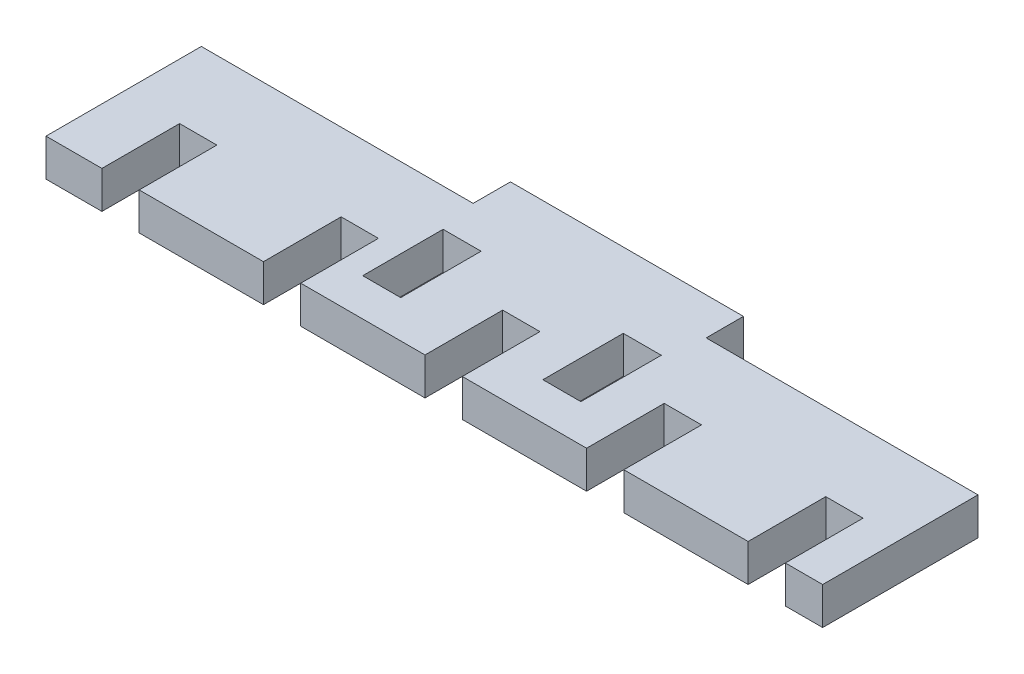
ISO-10303-21;
HEADER;
FILE_DESCRIPTION(('STEP AP214'),'2;1');
FILE_NAME('part.step','',(''),(''),'','','');
FILE_SCHEMA(('AUTOMOTIVE_DESIGN { 1 0 10303 214 1 1 1 1 }'));
ENDSEC;
DATA;
#1=APPLICATION_CONTEXT('core data for automotive mechanical design processes');
#2=APPLICATION_PROTOCOL_DEFINITION('international standard','automotive_design',2000,#1);
#3=PRODUCT_CONTEXT('',#1,'mechanical');
#4=PRODUCT('Part','Part','',(#3));
#5=PRODUCT_RELATED_PRODUCT_CATEGORY('part','',(#4));
#6=PRODUCT_DEFINITION_FORMATION('','',#4);
#7=PRODUCT_DEFINITION_CONTEXT('part definition',#1,'design');
#8=PRODUCT_DEFINITION('design','',#6,#7);
#9=PRODUCT_DEFINITION_SHAPE('','',#8);
#10=(LENGTH_UNIT() NAMED_UNIT(*) SI_UNIT(.MILLI.,.METRE.));
#11=(NAMED_UNIT(*) PLANE_ANGLE_UNIT() SI_UNIT($,.RADIAN.));
#12=(NAMED_UNIT(*) SI_UNIT($,.STERADIAN.) SOLID_ANGLE_UNIT());
#13=UNCERTAINTY_MEASURE_WITH_UNIT(LENGTH_MEASURE(1.E-05),#10,'distance_accuracy_value','');
#14=(GEOMETRIC_REPRESENTATION_CONTEXT(3) GLOBAL_UNCERTAINTY_ASSIGNED_CONTEXT((#13)) GLOBAL_UNIT_ASSIGNED_CONTEXT((#10,
#11,#12)) REPRESENTATION_CONTEXT('',''));
#15=CARTESIAN_POINT('',(0.,0.,0.));
#16=DIRECTION('',(0.,0.,1.));
#17=DIRECTION('',(1.,0.,0.));
#18=AXIS2_PLACEMENT_3D('',#15,#16,#17);
#19=CARTESIAN_POINT('',(0.,1.524,0.));
#20=DIRECTION('',(0.,1.,0.));
#21=DIRECTION('',(0.,0.,1.));
#22=AXIS2_PLACEMENT_3D('',#19,#20,#21);
#23=PLANE('',#22);
#24=DIRECTION('',(1.,0.,0.));
#25=VECTOR('',#24,1.);
#26=CARTESIAN_POINT('',(9.22231229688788,1.524,4.81768318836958));
#27=LINE('',#26,#25);
#28=CARTESIAN_POINT('',(7.66868770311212,1.524,4.81768318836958));
#29=VERTEX_POINT('',#28);
#30=CARTESIAN_POINT('',(9.22231229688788,1.524,4.81768318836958));
#31=VERTEX_POINT('',#30);
#32=EDGE_CURVE('E309',#29,#31,#27,.T.);
#33=ORIENTED_EDGE('',*,*,#32,.F.);
#34=DIRECTION('',(0.,0.,1.));
#35=VECTOR('',#34,1.);
#36=CARTESIAN_POINT('',(7.66868770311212,1.524,1.5323168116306));
#37=LINE('',#36,#35);
#38=CARTESIAN_POINT('',(7.66868770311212,1.524,1.5323168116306));
#39=VERTEX_POINT('',#38);
#40=EDGE_CURVE('E307',#39,#29,#37,.T.);
#41=ORIENTED_EDGE('',*,*,#40,.F.);
#42=DIRECTION('',(-1.,0.,0.));
#43=VECTOR('',#42,1.);
#44=CARTESIAN_POINT('',(9.22231229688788,1.524,1.5323168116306));
#45=LINE('',#44,#43);
#46=CARTESIAN_POINT('',(9.22231229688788,1.524,1.5323168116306));
#47=VERTEX_POINT('',#46);
#48=EDGE_CURVE('E315',#47,#39,#45,.T.);
#49=ORIENTED_EDGE('',*,*,#48,.F.);
#50=DIRECTION('',(0.,0.,-1.));
#51=VECTOR('',#50,1.);
#52=CARTESIAN_POINT('',(9.22231229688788,1.524,1.5323168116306));
#53=LINE('',#52,#51);
#54=EDGE_CURVE('E312',#31,#47,#53,.T.);
#55=ORIENTED_EDGE('',*,*,#54,.F.);
#56=EDGE_LOOP('',(#33,#41,#49,#55));
#57=FACE_BOUND('',#56,.T.);
#58=DIRECTION('',(-1.,0.,0.));
#59=VECTOR('',#58,1.);
#60=CARTESIAN_POINT('',(0.,1.524,0.));
#61=LINE('',#60,#59);
#62=CARTESIAN_POINT('',(0.,1.524,0.));
#63=VERTEX_POINT('',#62);
#64=CARTESIAN_POINT('',(-11.1125,1.524,0.));
#65=VERTEX_POINT('',#64);
#66=EDGE_CURVE('E338',#63,#65,#61,.T.);
#67=ORIENTED_EDGE('',*,*,#66,.T.);
#68=DIRECTION('',(0.,0.,1.));
#69=VECTOR('',#68,1.);
#70=CARTESIAN_POINT('',(-11.1125,1.524,0.));
#71=LINE('',#70,#69);
#72=CARTESIAN_POINT('',(-11.1125,1.524,6.35));
#73=VERTEX_POINT('',#72);
#74=EDGE_CURVE('E341',#65,#73,#71,.T.);
#75=ORIENTED_EDGE('',*,*,#74,.T.);
#76=DIRECTION('',(1.,0.,0.));
#77=VECTOR('',#76,1.);
#78=CARTESIAN_POINT('',(-11.1125,1.524,6.35));
#79=LINE('',#78,#77);
#80=CARTESIAN_POINT('',(-8.8265,1.524,6.35000000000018));
#81=VERTEX_POINT('',#80);
#82=EDGE_CURVE('E344',#73,#81,#79,.T.);
#83=ORIENTED_EDGE('',*,*,#82,.T.);
#84=DIRECTION('',(0.,0.,-1.));
#85=VECTOR('',#84,1.);
#86=CARTESIAN_POINT('',(-8.8265,1.524,3.17500000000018));
#87=LINE('',#86,#85);
#88=CARTESIAN_POINT('',(-8.8265,1.524,3.17500000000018));
#89=VERTEX_POINT('',#88);
#90=EDGE_CURVE('E346',#81,#89,#87,.T.);
#91=ORIENTED_EDGE('',*,*,#90,.T.);
#92=DIRECTION('',(1.,0.,0.));
#93=VECTOR('',#92,1.);
#94=CARTESIAN_POINT('',(-7.3025,1.524,3.17500000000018));
#95=LINE('',#94,#93);
#96=CARTESIAN_POINT('',(-7.3025,1.524,3.17500000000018));
#97=VERTEX_POINT('',#96);
#98=EDGE_CURVE('E348',#89,#97,#95,.T.);
#99=ORIENTED_EDGE('',*,*,#98,.T.);
#100=DIRECTION('',(0.,0.,1.));
#101=VECTOR('',#100,1.);
#102=CARTESIAN_POINT('',(-7.3025,1.524,3.17500000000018));
#103=LINE('',#102,#101);
#104=CARTESIAN_POINT('',(-7.3025,1.524,6.35000000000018));
#105=VERTEX_POINT('',#104);
#106=EDGE_CURVE('E350',#97,#105,#103,.T.);
#107=ORIENTED_EDGE('',*,*,#106,.T.);
#108=DIRECTION('',(1.,0.,0.));
#109=VECTOR('',#108,1.);
#110=CARTESIAN_POINT('',(-7.3025,1.524,6.35000000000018));
#111=LINE('',#110,#109);
#112=CARTESIAN_POINT('',(-2.2225,1.524,6.35000000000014));
#113=VERTEX_POINT('',#112);
#114=EDGE_CURVE('E352',#105,#113,#111,.T.);
#115=ORIENTED_EDGE('',*,*,#114,.T.);
#116=DIRECTION('',(0.,0.,-1.));
#117=VECTOR('',#116,1.);
#118=CARTESIAN_POINT('',(-2.2225,1.524,3.17500000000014));
#119=LINE('',#118,#117);
#120=CARTESIAN_POINT('',(-2.2225,1.524,3.17500000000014));
#121=VERTEX_POINT('',#120);
#122=EDGE_CURVE('E354',#113,#121,#119,.T.);
#123=ORIENTED_EDGE('',*,*,#122,.T.);
#124=DIRECTION('',(1.,0.,0.));
#125=VECTOR('',#124,1.);
#126=CARTESIAN_POINT('',(-0.698500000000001,1.524,3.17500000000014));
#127=LINE('',#126,#125);
#128=CARTESIAN_POINT('',(-0.698500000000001,1.524,3.17500000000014));
#129=VERTEX_POINT('',#128);
#130=EDGE_CURVE('E356',#121,#129,#127,.T.);
#131=ORIENTED_EDGE('',*,*,#130,.T.);
#132=DIRECTION('',(0.,0.,1.));
#133=VECTOR('',#132,1.);
#134=CARTESIAN_POINT('',(-0.698500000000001,1.524,3.17500000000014));
#135=LINE('',#134,#133);
#136=CARTESIAN_POINT('',(-0.698500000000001,1.524,6.35000000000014));
#137=VERTEX_POINT('',#136);
#138=EDGE_CURVE('E358',#129,#137,#135,.T.);
#139=ORIENTED_EDGE('',*,*,#138,.T.);
#140=DIRECTION('',(1.,0.,0.));
#141=VECTOR('',#140,1.);
#142=CARTESIAN_POINT('',(-0.698500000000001,1.524,6.35000000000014));
#143=LINE('',#142,#141);
#144=CARTESIAN_POINT('',(4.3815,1.524,6.35000000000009));
#145=VERTEX_POINT('',#144);
#146=EDGE_CURVE('E360',#137,#145,#143,.T.);
#147=ORIENTED_EDGE('',*,*,#146,.T.);
#148=DIRECTION('',(0.,0.,-1.));
#149=VECTOR('',#148,1.);
#150=CARTESIAN_POINT('',(4.3815,1.524,3.17500000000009));
#151=LINE('',#150,#149);
#152=CARTESIAN_POINT('',(4.3815,1.524,3.17500000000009));
#153=VERTEX_POINT('',#152);
#154=EDGE_CURVE('E362',#145,#153,#151,.T.);
#155=ORIENTED_EDGE('',*,*,#154,.T.);
#156=DIRECTION('',(1.,0.,0.));
#157=VECTOR('',#156,1.);
#158=CARTESIAN_POINT('',(5.9055,1.524,3.17500000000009));
#159=LINE('',#158,#157);
#160=CARTESIAN_POINT('',(5.9055,1.524,3.17500000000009));
#161=VERTEX_POINT('',#160);
#162=EDGE_CURVE('E364',#153,#161,#159,.T.);
#163=ORIENTED_EDGE('',*,*,#162,.T.);
#164=DIRECTION('',(0.,0.,1.));
#165=VECTOR('',#164,1.);
#166=CARTESIAN_POINT('',(5.9055,1.524,3.17500000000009));
#167=LINE('',#166,#165);
#168=CARTESIAN_POINT('',(5.9055,1.524,6.35000000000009));
#169=VERTEX_POINT('',#168);
#170=EDGE_CURVE('E366',#161,#169,#167,.T.);
#171=ORIENTED_EDGE('',*,*,#170,.T.);
#172=DIRECTION('',(1.,0.,0.));
#173=VECTOR('',#172,1.);
#174=CARTESIAN_POINT('',(5.9055,1.524,6.35000000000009));
#175=LINE('',#174,#173);
#176=CARTESIAN_POINT('',(10.9855,1.524,6.35000000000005));
#177=VERTEX_POINT('',#176);
#178=EDGE_CURVE('E368',#169,#177,#175,.T.);
#179=ORIENTED_EDGE('',*,*,#178,.T.);
#180=DIRECTION('',(0.,0.,-1.));
#181=VECTOR('',#180,1.);
#182=CARTESIAN_POINT('',(10.9855,1.524,3.17500000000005));
#183=LINE('',#182,#181);
#184=CARTESIAN_POINT('',(10.9855,1.524,3.17500000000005));
#185=VERTEX_POINT('',#184);
#186=EDGE_CURVE('E370',#177,#185,#183,.T.);
#187=ORIENTED_EDGE('',*,*,#186,.T.);
#188=DIRECTION('',(1.,0.,0.));
#189=VECTOR('',#188,1.);
#190=CARTESIAN_POINT('',(12.5095,1.524,3.17500000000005));
#191=LINE('',#190,#189);
#192=CARTESIAN_POINT('',(12.5095,1.524,3.17500000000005));
#193=VERTEX_POINT('',#192);
#194=EDGE_CURVE('E372',#185,#193,#191,.T.);
#195=ORIENTED_EDGE('',*,*,#194,.T.);
#196=DIRECTION('',(0.,0.,1.));
#197=VECTOR('',#196,1.);
#198=CARTESIAN_POINT('',(12.5095,1.524,3.17500000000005));
#199=LINE('',#198,#197);
#200=CARTESIAN_POINT('',(12.5095,1.524,6.35000000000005));
#201=VERTEX_POINT('',#200);
#202=EDGE_CURVE('E374',#193,#201,#199,.T.);
#203=ORIENTED_EDGE('',*,*,#202,.T.);
#204=DIRECTION('',(1.,0.,0.));
#205=VECTOR('',#204,1.);
#206=CARTESIAN_POINT('',(12.5095,1.524,6.35000000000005));
#207=LINE('',#206,#205);
#208=CARTESIAN_POINT('',(17.5895,1.524,6.35));
#209=VERTEX_POINT('',#208);
#210=EDGE_CURVE('E376',#201,#209,#207,.T.);
#211=ORIENTED_EDGE('',*,*,#210,.T.);
#212=DIRECTION('',(0.,0.,-1.));
#213=VECTOR('',#212,1.);
#214=CARTESIAN_POINT('',(17.5895,1.524,3.175));
#215=LINE('',#214,#213);
#216=CARTESIAN_POINT('',(17.5895,1.524,3.175));
#217=VERTEX_POINT('',#216);
#218=EDGE_CURVE('E378',#209,#217,#215,.T.);
#219=ORIENTED_EDGE('',*,*,#218,.T.);
#220=DIRECTION('',(1.,0.,0.));
#221=VECTOR('',#220,1.);
#222=CARTESIAN_POINT('',(19.1135,1.524,3.175));
#223=LINE('',#222,#221);
#224=CARTESIAN_POINT('',(19.1135,1.524,3.175));
#225=VERTEX_POINT('',#224);
#226=EDGE_CURVE('E380',#217,#225,#223,.T.);
#227=ORIENTED_EDGE('',*,*,#226,.T.);
#228=DIRECTION('',(0.,0.,1.));
#229=VECTOR('',#228,1.);
#230=CARTESIAN_POINT('',(19.1135,1.524,3.175));
#231=LINE('',#230,#229);
#232=CARTESIAN_POINT('',(19.1135,1.524,6.35));
#233=VERTEX_POINT('',#232);
#234=EDGE_CURVE('E382',#225,#233,#231,.T.);
#235=ORIENTED_EDGE('',*,*,#234,.T.);
#236=DIRECTION('',(1.,0.,0.));
#237=VECTOR('',#236,1.);
#238=CARTESIAN_POINT('',(19.1135,1.524,6.35));
#239=LINE('',#238,#237);
#240=CARTESIAN_POINT('',(20.6375,1.524,6.35));
#241=VERTEX_POINT('',#240);
#242=EDGE_CURVE('E384',#233,#241,#239,.T.);
#243=ORIENTED_EDGE('',*,*,#242,.T.);
#244=DIRECTION('',(0.,0.,-1.));
#245=VECTOR('',#244,1.);
#246=CARTESIAN_POINT('',(20.6375,1.524,0.));
#247=LINE('',#246,#245);
#248=CARTESIAN_POINT('',(20.6375,1.524,0.));
#249=VERTEX_POINT('',#248);
#250=EDGE_CURVE('E386',#241,#249,#247,.T.);
#251=ORIENTED_EDGE('',*,*,#250,.T.);
#252=DIRECTION('',(-1.,0.,0.));
#253=VECTOR('',#252,1.);
#254=CARTESIAN_POINT('',(20.6375,1.524,0.));
#255=LINE('',#254,#253);
#256=CARTESIAN_POINT('',(9.525,1.524,0.));
#257=VERTEX_POINT('',#256);
#258=EDGE_CURVE('E388',#249,#257,#255,.T.);
#259=ORIENTED_EDGE('',*,*,#258,.T.);
#260=DIRECTION('',(0.,0.,-1.));
#261=VECTOR('',#260,1.);
#262=CARTESIAN_POINT('',(9.525,1.524,0.));
#263=LINE('',#262,#261);
#264=CARTESIAN_POINT('',(9.525,1.524,-1.524));
#265=VERTEX_POINT('',#264);
#266=EDGE_CURVE('E390',#257,#265,#263,.T.);
#267=ORIENTED_EDGE('',*,*,#266,.T.);
#268=DIRECTION('',(-1.,0.,0.));
#269=VECTOR('',#268,1.);
#270=CARTESIAN_POINT('',(0.,1.524,-1.524));
#271=LINE('',#270,#269);
#272=CARTESIAN_POINT('',(0.,1.524,-1.524));
#273=VERTEX_POINT('',#272);
#274=EDGE_CURVE('E392',#265,#273,#271,.T.);
#275=ORIENTED_EDGE('',*,*,#274,.T.);
#276=DIRECTION('',(0.,0.,1.));
#277=VECTOR('',#276,1.);
#278=CARTESIAN_POINT('',(0.,1.524,0.));
#279=LINE('',#278,#277);
#280=EDGE_CURVE('E394',#273,#63,#279,.T.);
#281=ORIENTED_EDGE('',*,*,#280,.T.);
#282=EDGE_LOOP('',(#67,#75,#83,#91,#99,#107,#115,#123,#131,#139,#147,#155,#163,#171,#179,#187,
#195,#203,#211,#219,#227,#235,#243,#251,#259,#267,#275,#281));
#283=FACE_BOUND('',#282,.T.);
#284=DIRECTION('',(1.,0.,0.));
#285=VECTOR('',#284,1.);
#286=CARTESIAN_POINT('',(0.302687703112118,1.524,4.81768318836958));
#287=LINE('',#286,#285);
#288=CARTESIAN_POINT('',(0.302687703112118,1.524,4.81768318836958));
#289=VERTEX_POINT('',#288);
#290=CARTESIAN_POINT('',(1.85631229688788,1.524,4.81768318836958));
#291=VERTEX_POINT('',#290);
#292=EDGE_CURVE('E279',#289,#291,#287,.T.);
#293=ORIENTED_EDGE('',*,*,#292,.F.);
#294=DIRECTION('',(0.,0.,1.));
#295=VECTOR('',#294,1.);
#296=CARTESIAN_POINT('',(0.302687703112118,1.524,1.5323168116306));
#297=LINE('',#296,#295);
#298=CARTESIAN_POINT('',(0.302687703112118,1.524,1.5323168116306));
#299=VERTEX_POINT('',#298);
#300=EDGE_CURVE('E271',#299,#289,#297,.T.);
#301=ORIENTED_EDGE('',*,*,#300,.F.);
#302=DIRECTION('',(-1.,0.,0.));
#303=VECTOR('',#302,1.);
#304=CARTESIAN_POINT('',(0.302687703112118,1.524,1.5323168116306));
#305=LINE('',#304,#303);
#306=CARTESIAN_POINT('',(1.85631229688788,1.524,1.5323168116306));
#307=VERTEX_POINT('',#306);
#308=EDGE_CURVE('E293',#307,#299,#305,.T.);
#309=ORIENTED_EDGE('',*,*,#308,.F.);
#310=DIRECTION('',(0.,0.,-1.));
#311=VECTOR('',#310,1.);
#312=CARTESIAN_POINT('',(1.85631229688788,1.524,1.5323168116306));
#313=LINE('',#312,#311);
#314=EDGE_CURVE('E291',#291,#307,#313,.T.);
#315=ORIENTED_EDGE('',*,*,#314,.F.);
#316=EDGE_LOOP('',(#293,#301,#309,#315));
#317=FACE_BOUND('',#316,.T.);
#318=ADVANCED_FACE('F38',(#57,#283,#317),#23,.T.);
#319=CARTESIAN_POINT('',(0.,0.,0.));
#320=DIRECTION('',(0.,1.,0.));
#321=DIRECTION('',(0.,0.,1.));
#322=AXIS2_PLACEMENT_3D('',#319,#320,#321);
#323=PLANE('',#322);
#324=DIRECTION('',(0.,0.,1.));
#325=VECTOR('',#324,1.);
#326=CARTESIAN_POINT('',(7.66868770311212,0.,1.5323168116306));
#327=LINE('',#326,#325);
#328=CARTESIAN_POINT('',(7.66868770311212,0.,1.5323168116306));
#329=VERTEX_POINT('',#328);
#330=CARTESIAN_POINT('',(7.66868770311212,0.,4.81768318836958));
#331=VERTEX_POINT('',#330);
#332=EDGE_CURVE('E287',#329,#331,#327,.T.);
#333=ORIENTED_EDGE('',*,*,#332,.T.);
#334=DIRECTION('',(1.,0.,0.));
#335=VECTOR('',#334,1.);
#336=CARTESIAN_POINT('',(9.22231229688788,0.,4.81768318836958));
#337=LINE('',#336,#335);
#338=CARTESIAN_POINT('',(9.22231229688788,0.,4.81768318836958));
#339=VERTEX_POINT('',#338);
#340=EDGE_CURVE('E320',#331,#339,#337,.T.);
#341=ORIENTED_EDGE('',*,*,#340,.T.);
#342=DIRECTION('',(0.,0.,-1.));
#343=VECTOR('',#342,1.);
#344=CARTESIAN_POINT('',(9.22231229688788,0.,1.5323168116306));
#345=LINE('',#344,#343);
#346=CARTESIAN_POINT('',(9.22231229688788,0.,1.5323168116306));
#347=VERTEX_POINT('',#346);
#348=EDGE_CURVE('E323',#339,#347,#345,.T.);
#349=ORIENTED_EDGE('',*,*,#348,.T.);
#350=DIRECTION('',(-1.,0.,0.));
#351=VECTOR('',#350,1.);
#352=CARTESIAN_POINT('',(9.22231229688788,0.,1.5323168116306));
#353=LINE('',#352,#351);
#354=EDGE_CURVE('E310',#347,#329,#353,.T.);
#355=ORIENTED_EDGE('',*,*,#354,.T.);
#356=EDGE_LOOP('',(#333,#341,#349,#355));
#357=FACE_BOUND('',#356,.T.);
#358=DIRECTION('',(-1.,0.,0.));
#359=VECTOR('',#358,1.);
#360=CARTESIAN_POINT('',(0.,0.,0.));
#361=LINE('',#360,#359);
#362=CARTESIAN_POINT('',(0.,0.,0.));
#363=VERTEX_POINT('',#362);
#364=CARTESIAN_POINT('',(-11.1125,0.,0.));
#365=VERTEX_POINT('',#364);
#366=EDGE_CURVE('E337',#363,#365,#361,.T.);
#367=ORIENTED_EDGE('',*,*,#366,.F.);
#368=DIRECTION('',(0.,0.,1.));
#369=VECTOR('',#368,1.);
#370=CARTESIAN_POINT('',(0.,0.,0.));
#371=LINE('',#370,#369);
#372=CARTESIAN_POINT('',(0.,0.,-1.524));
#373=VERTEX_POINT('',#372);
#374=EDGE_CURVE('E342',#373,#363,#371,.T.);
#375=ORIENTED_EDGE('',*,*,#374,.F.);
#376=DIRECTION('',(-1.,0.,0.));
#377=VECTOR('',#376,1.);
#378=CARTESIAN_POINT('',(0.,0.,-1.524));
#379=LINE('',#378,#377);
#380=CARTESIAN_POINT('',(9.525,0.,-1.524));
#381=VERTEX_POINT('',#380);
#382=EDGE_CURVE('E449',#381,#373,#379,.T.);
#383=ORIENTED_EDGE('',*,*,#382,.F.);
#384=DIRECTION('',(0.,0.,-1.));
#385=VECTOR('',#384,1.);
#386=CARTESIAN_POINT('',(9.525,0.,0.));
#387=LINE('',#386,#385);
#388=CARTESIAN_POINT('',(9.525,0.,0.));
#389=VERTEX_POINT('',#388);
#390=EDGE_CURVE('E447',#389,#381,#387,.T.);
#391=ORIENTED_EDGE('',*,*,#390,.F.);
#392=DIRECTION('',(-1.,0.,0.));
#393=VECTOR('',#392,1.);
#394=CARTESIAN_POINT('',(20.6375,0.,0.));
#395=LINE('',#394,#393);
#396=CARTESIAN_POINT('',(20.6375,0.,0.));
#397=VERTEX_POINT('',#396);
#398=EDGE_CURVE('E445',#397,#389,#395,.T.);
#399=ORIENTED_EDGE('',*,*,#398,.F.);
#400=DIRECTION('',(0.,0.,-1.));
#401=VECTOR('',#400,1.);
#402=CARTESIAN_POINT('',(20.6375,0.,0.));
#403=LINE('',#402,#401);
#404=CARTESIAN_POINT('',(20.6375,0.,6.35));
#405=VERTEX_POINT('',#404);
#406=EDGE_CURVE('E443',#405,#397,#403,.T.);
#407=ORIENTED_EDGE('',*,*,#406,.F.);
#408=DIRECTION('',(1.,0.,0.));
#409=VECTOR('',#408,1.);
#410=CARTESIAN_POINT('',(19.1135,0.,6.35));
#411=LINE('',#410,#409);
#412=CARTESIAN_POINT('',(19.1135,0.,6.35));
#413=VERTEX_POINT('',#412);
#414=EDGE_CURVE('E441',#413,#405,#411,.T.);
#415=ORIENTED_EDGE('',*,*,#414,.F.);
#416=DIRECTION('',(0.,0.,1.));
#417=VECTOR('',#416,1.);
#418=CARTESIAN_POINT('',(19.1135,0.,3.175));
#419=LINE('',#418,#417);
#420=CARTESIAN_POINT('',(19.1135,0.,3.175));
#421=VERTEX_POINT('',#420);
#422=EDGE_CURVE('E439',#421,#413,#419,.T.);
#423=ORIENTED_EDGE('',*,*,#422,.F.);
#424=DIRECTION('',(1.,0.,0.));
#425=VECTOR('',#424,1.);
#426=CARTESIAN_POINT('',(19.1135,0.,3.175));
#427=LINE('',#426,#425);
#428=CARTESIAN_POINT('',(17.5895,0.,3.175));
#429=VERTEX_POINT('',#428);
#430=EDGE_CURVE('E437',#429,#421,#427,.T.);
#431=ORIENTED_EDGE('',*,*,#430,.F.);
#432=DIRECTION('',(0.,0.,-1.));
#433=VECTOR('',#432,1.);
#434=CARTESIAN_POINT('',(17.5895,0.,3.175));
#435=LINE('',#434,#433);
#436=CARTESIAN_POINT('',(17.5895,0.,6.35));
#437=VERTEX_POINT('',#436);
#438=EDGE_CURVE('E435',#437,#429,#435,.T.);
#439=ORIENTED_EDGE('',*,*,#438,.F.);
#440=DIRECTION('',(1.,0.,0.));
#441=VECTOR('',#440,1.);
#442=CARTESIAN_POINT('',(12.5095,0.,6.35000000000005));
#443=LINE('',#442,#441);
#444=CARTESIAN_POINT('',(12.5095,0.,6.35000000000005));
#445=VERTEX_POINT('',#444);
#446=EDGE_CURVE('E433',#445,#437,#443,.T.);
#447=ORIENTED_EDGE('',*,*,#446,.F.);
#448=DIRECTION('',(0.,0.,1.));
#449=VECTOR('',#448,1.);
#450=CARTESIAN_POINT('',(12.5095,0.,3.17500000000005));
#451=LINE('',#450,#449);
#452=CARTESIAN_POINT('',(12.5095,0.,3.17500000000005));
#453=VERTEX_POINT('',#452);
#454=EDGE_CURVE('E431',#453,#445,#451,.T.);
#455=ORIENTED_EDGE('',*,*,#454,.F.);
#456=DIRECTION('',(1.,0.,0.));
#457=VECTOR('',#456,1.);
#458=CARTESIAN_POINT('',(12.5095,0.,3.17500000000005));
#459=LINE('',#458,#457);
#460=CARTESIAN_POINT('',(10.9855,0.,3.17500000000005));
#461=VERTEX_POINT('',#460);
#462=EDGE_CURVE('E429',#461,#453,#459,.T.);
#463=ORIENTED_EDGE('',*,*,#462,.F.);
#464=DIRECTION('',(0.,0.,-1.));
#465=VECTOR('',#464,1.);
#466=CARTESIAN_POINT('',(10.9855,0.,3.17500000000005));
#467=LINE('',#466,#465);
#468=CARTESIAN_POINT('',(10.9855,0.,6.35000000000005));
#469=VERTEX_POINT('',#468);
#470=EDGE_CURVE('E427',#469,#461,#467,.T.);
#471=ORIENTED_EDGE('',*,*,#470,.F.);
#472=DIRECTION('',(1.,0.,0.));
#473=VECTOR('',#472,1.);
#474=CARTESIAN_POINT('',(5.9055,0.,6.35000000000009));
#475=LINE('',#474,#473);
#476=CARTESIAN_POINT('',(5.9055,0.,6.35000000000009));
#477=VERTEX_POINT('',#476);
#478=EDGE_CURVE('E425',#477,#469,#475,.T.);
#479=ORIENTED_EDGE('',*,*,#478,.F.);
#480=DIRECTION('',(0.,0.,1.));
#481=VECTOR('',#480,1.);
#482=CARTESIAN_POINT('',(5.9055,0.,3.17500000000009));
#483=LINE('',#482,#481);
#484=CARTESIAN_POINT('',(5.9055,0.,3.17500000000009));
#485=VERTEX_POINT('',#484);
#486=EDGE_CURVE('E423',#485,#477,#483,.T.);
#487=ORIENTED_EDGE('',*,*,#486,.F.);
#488=DIRECTION('',(1.,0.,0.));
#489=VECTOR('',#488,1.);
#490=CARTESIAN_POINT('',(5.9055,0.,3.17500000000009));
#491=LINE('',#490,#489);
#492=CARTESIAN_POINT('',(4.3815,0.,3.17500000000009));
#493=VERTEX_POINT('',#492);
#494=EDGE_CURVE('E421',#493,#485,#491,.T.);
#495=ORIENTED_EDGE('',*,*,#494,.F.);
#496=DIRECTION('',(0.,0.,-1.));
#497=VECTOR('',#496,1.);
#498=CARTESIAN_POINT('',(4.3815,0.,3.17500000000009));
#499=LINE('',#498,#497);
#500=CARTESIAN_POINT('',(4.3815,0.,6.35000000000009));
#501=VERTEX_POINT('',#500);
#502=EDGE_CURVE('E419',#501,#493,#499,.T.);
#503=ORIENTED_EDGE('',*,*,#502,.F.);
#504=DIRECTION('',(1.,0.,0.));
#505=VECTOR('',#504,1.);
#506=CARTESIAN_POINT('',(-0.698500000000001,0.,6.35000000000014));
#507=LINE('',#506,#505);
#508=CARTESIAN_POINT('',(-0.698500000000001,0.,6.35000000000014));
#509=VERTEX_POINT('',#508);
#510=EDGE_CURVE('E417',#509,#501,#507,.T.);
#511=ORIENTED_EDGE('',*,*,#510,.F.);
#512=DIRECTION('',(0.,0.,1.));
#513=VECTOR('',#512,1.);
#514=CARTESIAN_POINT('',(-0.698500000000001,0.,3.17500000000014));
#515=LINE('',#514,#513);
#516=CARTESIAN_POINT('',(-0.698500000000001,0.,3.17500000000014));
#517=VERTEX_POINT('',#516);
#518=EDGE_CURVE('E415',#517,#509,#515,.T.);
#519=ORIENTED_EDGE('',*,*,#518,.F.);
#520=DIRECTION('',(1.,0.,0.));
#521=VECTOR('',#520,1.);
#522=CARTESIAN_POINT('',(-0.698500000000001,0.,3.17500000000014));
#523=LINE('',#522,#521);
#524=CARTESIAN_POINT('',(-2.2225,0.,3.17500000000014));
#525=VERTEX_POINT('',#524);
#526=EDGE_CURVE('E413',#525,#517,#523,.T.);
#527=ORIENTED_EDGE('',*,*,#526,.F.);
#528=DIRECTION('',(0.,0.,-1.));
#529=VECTOR('',#528,1.);
#530=CARTESIAN_POINT('',(-2.2225,0.,3.17500000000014));
#531=LINE('',#530,#529);
#532=CARTESIAN_POINT('',(-2.2225,0.,6.35000000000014));
#533=VERTEX_POINT('',#532);
#534=EDGE_CURVE('E411',#533,#525,#531,.T.);
#535=ORIENTED_EDGE('',*,*,#534,.F.);
#536=DIRECTION('',(1.,0.,0.));
#537=VECTOR('',#536,1.);
#538=CARTESIAN_POINT('',(-7.3025,0.,6.35000000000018));
#539=LINE('',#538,#537);
#540=CARTESIAN_POINT('',(-7.3025,0.,6.35000000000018));
#541=VERTEX_POINT('',#540);
#542=EDGE_CURVE('E409',#541,#533,#539,.T.);
#543=ORIENTED_EDGE('',*,*,#542,.F.);
#544=DIRECTION('',(0.,0.,1.));
#545=VECTOR('',#544,1.);
#546=CARTESIAN_POINT('',(-7.3025,0.,3.17500000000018));
#547=LINE('',#546,#545);
#548=CARTESIAN_POINT('',(-7.3025,0.,3.17500000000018));
#549=VERTEX_POINT('',#548);
#550=EDGE_CURVE('E407',#549,#541,#547,.T.);
#551=ORIENTED_EDGE('',*,*,#550,.F.);
#552=DIRECTION('',(1.,0.,0.));
#553=VECTOR('',#552,1.);
#554=CARTESIAN_POINT('',(-7.3025,0.,3.17500000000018));
#555=LINE('',#554,#553);
#556=CARTESIAN_POINT('',(-8.8265,0.,3.17500000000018));
#557=VERTEX_POINT('',#556);
#558=EDGE_CURVE('E405',#557,#549,#555,.T.);
#559=ORIENTED_EDGE('',*,*,#558,.F.);
#560=DIRECTION('',(0.,0.,-1.));
#561=VECTOR('',#560,1.);
#562=CARTESIAN_POINT('',(-8.8265,0.,3.17500000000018));
#563=LINE('',#562,#561);
#564=CARTESIAN_POINT('',(-8.8265,0.,6.35000000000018));
#565=VERTEX_POINT('',#564);
#566=EDGE_CURVE('E403',#565,#557,#563,.T.);
#567=ORIENTED_EDGE('',*,*,#566,.F.);
#568=DIRECTION('',(1.,0.,0.));
#569=VECTOR('',#568,1.);
#570=CARTESIAN_POINT('',(-11.1125,0.,6.35));
#571=LINE('',#570,#569);
#572=CARTESIAN_POINT('',(-11.1125,0.,6.35));
#573=VERTEX_POINT('',#572);
#574=EDGE_CURVE('E401',#573,#565,#571,.T.);
#575=ORIENTED_EDGE('',*,*,#574,.F.);
#576=DIRECTION('',(0.,0.,1.));
#577=VECTOR('',#576,1.);
#578=CARTESIAN_POINT('',(-11.1125,0.,0.));
#579=LINE('',#578,#577);
#580=EDGE_CURVE('E399',#365,#573,#579,.T.);
#581=ORIENTED_EDGE('',*,*,#580,.F.);
#582=EDGE_LOOP('',(#367,#375,#383,#391,#399,#407,#415,#423,#431,#439,#447,#455,#463,#471,#479,
#487,#495,#503,#511,#519,#527,#535,#543,#551,#559,#567,#575,#581));
#583=FACE_BOUND('',#582,.T.);
#584=DIRECTION('',(0.,0.,1.));
#585=VECTOR('',#584,1.);
#586=CARTESIAN_POINT('',(0.302687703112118,0.,1.5323168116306));
#587=LINE('',#586,#585);
#588=CARTESIAN_POINT('',(0.302687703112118,0.,1.5323168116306));
#589=VERTEX_POINT('',#588);
#590=CARTESIAN_POINT('',(0.302687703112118,0.,4.81768318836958));
#591=VERTEX_POINT('',#590);
#592=EDGE_CURVE('E61',#589,#591,#587,.T.);
#593=ORIENTED_EDGE('',*,*,#592,.T.);
#594=DIRECTION('',(1.,0.,0.));
#595=VECTOR('',#594,1.);
#596=CARTESIAN_POINT('',(0.302687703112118,0.,4.81768318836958));
#597=LINE('',#596,#595);
#598=CARTESIAN_POINT('',(1.85631229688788,0.,4.81768318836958));
#599=VERTEX_POINT('',#598);
#600=EDGE_CURVE('E286',#591,#599,#597,.T.);
#601=ORIENTED_EDGE('',*,*,#600,.T.);
#602=DIRECTION('',(0.,0.,-1.));
#603=VECTOR('',#602,1.);
#604=CARTESIAN_POINT('',(1.85631229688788,0.,1.5323168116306));
#605=LINE('',#604,#603);
#606=CARTESIAN_POINT('',(1.85631229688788,0.,1.5323168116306));
#607=VERTEX_POINT('',#606);
#608=EDGE_CURVE('E299',#599,#607,#605,.T.);
#609=ORIENTED_EDGE('',*,*,#608,.T.);
#610=DIRECTION('',(-1.,0.,0.));
#611=VECTOR('',#610,1.);
#612=CARTESIAN_POINT('',(0.302687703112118,0.,1.5323168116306));
#613=LINE('',#612,#611);
#614=EDGE_CURVE('E280',#607,#589,#613,.T.);
#615=ORIENTED_EDGE('',*,*,#614,.T.);
#616=EDGE_LOOP('',(#593,#601,#609,#615));
#617=FACE_BOUND('',#616,.T.);
#618=ADVANCED_FACE('F539',(#357,#583,#617),#323,.F.);
#619=CARTESIAN_POINT('',(0.,1.524,0.));
#620=DIRECTION('',(0.,0.,1.));
#621=DIRECTION('',(1.,0.,0.));
#622=AXIS2_PLACEMENT_3D('',#619,#620,#621);
#623=PLANE('',#622);
#624=ORIENTED_EDGE('',*,*,#366,.T.);
#625=DIRECTION('',(0.,-1.,0.));
#626=VECTOR('',#625,1.);
#627=CARTESIAN_POINT('',(-11.1125,1.524,0.));
#628=LINE('',#627,#626);
#629=EDGE_CURVE('E11',#65,#365,#628,.T.);
#630=ORIENTED_EDGE('',*,*,#629,.F.);
#631=ORIENTED_EDGE('',*,*,#66,.F.);
#632=DIRECTION('',(0.,-1.,0.));
#633=VECTOR('',#632,1.);
#634=CARTESIAN_POINT('',(0.,1.524,0.));
#635=LINE('',#634,#633);
#636=EDGE_CURVE('E396',#63,#363,#635,.T.);
#637=ORIENTED_EDGE('',*,*,#636,.T.);
#638=EDGE_LOOP('',(#624,#630,#631,#637));
#639=FACE_BOUND('',#638,.T.);
#640=ADVANCED_FACE('F40',(#639),#623,.F.);
#641=CARTESIAN_POINT('',(-11.1125,1.524,0.));
#642=DIRECTION('',(1.,0.,0.));
#643=DIRECTION('',(0.,0.,-1.));
#644=AXIS2_PLACEMENT_3D('',#641,#642,#643);
#645=PLANE('',#644);
#646=ORIENTED_EDGE('',*,*,#580,.T.);
#647=DIRECTION('',(0.,-1.,0.));
#648=VECTOR('',#647,1.);
#649=CARTESIAN_POINT('',(-11.1125,1.524,6.35));
#650=LINE('',#649,#648);
#651=EDGE_CURVE('E46',#73,#573,#650,.T.);
#652=ORIENTED_EDGE('',*,*,#651,.F.);
#653=ORIENTED_EDGE('',*,*,#74,.F.);
#654=ORIENTED_EDGE('',*,*,#629,.T.);
#655=EDGE_LOOP('',(#646,#652,#653,#654));
#656=FACE_BOUND('',#655,.T.);
#657=ADVANCED_FACE('F556',(#656),#645,.F.);
#658=CARTESIAN_POINT('',(-11.1125,1.524,6.35));
#659=DIRECTION('',(0.,0.,-1.));
#660=DIRECTION('',(-1.,0.,0.));
#661=AXIS2_PLACEMENT_3D('',#658,#659,#660);
#662=PLANE('',#661);
#663=ORIENTED_EDGE('',*,*,#574,.T.);
#664=DIRECTION('',(0.,-1.,0.));
#665=VECTOR('',#664,1.);
#666=CARTESIAN_POINT('',(-8.8265,1.524,6.35000000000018));
#667=LINE('',#666,#665);
#668=EDGE_CURVE('E526',#81,#565,#667,.T.);
#669=ORIENTED_EDGE('',*,*,#668,.F.);
#670=ORIENTED_EDGE('',*,*,#82,.F.);
#671=ORIENTED_EDGE('',*,*,#651,.T.);
#672=EDGE_LOOP('',(#663,#669,#670,#671));
#673=FACE_BOUND('',#672,.T.);
#674=ADVANCED_FACE('F533',(#673),#662,.F.);
#675=CARTESIAN_POINT('',(-8.8265,1.524,3.17500000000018));
#676=DIRECTION('',(-1.,0.,0.));
#677=DIRECTION('',(0.,0.,1.));
#678=AXIS2_PLACEMENT_3D('',#675,#676,#677);
#679=PLANE('',#678);
#680=ORIENTED_EDGE('',*,*,#566,.T.);
#681=DIRECTION('',(0.,-1.,0.));
#682=VECTOR('',#681,1.);
#683=CARTESIAN_POINT('',(-8.8265,1.524,3.17500000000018));
#684=LINE('',#683,#682);
#685=EDGE_CURVE('E523',#89,#557,#684,.T.);
#686=ORIENTED_EDGE('',*,*,#685,.F.);
#687=ORIENTED_EDGE('',*,*,#90,.F.);
#688=ORIENTED_EDGE('',*,*,#668,.T.);
#689=EDGE_LOOP('',(#680,#686,#687,#688));
#690=FACE_BOUND('',#689,.T.);
#691=ADVANCED_FACE('F545',(#690),#679,.F.);
#692=CARTESIAN_POINT('',(-7.3025,1.524,3.17500000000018));
#693=DIRECTION('',(0.,0.,-1.));
#694=DIRECTION('',(-1.,0.,0.));
#695=AXIS2_PLACEMENT_3D('',#692,#693,#694);
#696=PLANE('',#695);
#697=ORIENTED_EDGE('',*,*,#558,.T.);
#698=DIRECTION('',(0.,-1.,0.));
#699=VECTOR('',#698,1.);
#700=CARTESIAN_POINT('',(-7.3025,1.524,3.17500000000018));
#701=LINE('',#700,#699);
#702=EDGE_CURVE('E520',#97,#549,#701,.T.);
#703=ORIENTED_EDGE('',*,*,#702,.F.);
#704=ORIENTED_EDGE('',*,*,#98,.F.);
#705=ORIENTED_EDGE('',*,*,#685,.T.);
#706=EDGE_LOOP('',(#697,#703,#704,#705));
#707=FACE_BOUND('',#706,.T.);
#708=ADVANCED_FACE('F549',(#707),#696,.F.);
#709=CARTESIAN_POINT('',(-7.3025,1.524,3.17500000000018));
#710=DIRECTION('',(1.,0.,0.));
#711=DIRECTION('',(0.,0.,-1.));
#712=AXIS2_PLACEMENT_3D('',#709,#710,#711);
#713=PLANE('',#712);
#714=ORIENTED_EDGE('',*,*,#550,.T.);
#715=DIRECTION('',(0.,-1.,0.));
#716=VECTOR('',#715,1.);
#717=CARTESIAN_POINT('',(-7.3025,1.524,6.35000000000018));
#718=LINE('',#717,#716);
#719=EDGE_CURVE('E517',#105,#541,#718,.T.);
#720=ORIENTED_EDGE('',*,*,#719,.F.);
#721=ORIENTED_EDGE('',*,*,#106,.F.);
#722=ORIENTED_EDGE('',*,*,#702,.T.);
#723=EDGE_LOOP('',(#714,#720,#721,#722));
#724=FACE_BOUND('',#723,.T.);
#725=ADVANCED_FACE('F669',(#724),#713,.F.);
#726=CARTESIAN_POINT('',(-7.3025,1.524,6.35000000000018));
#727=DIRECTION('',(0.,0.,-1.));
#728=DIRECTION('',(-1.,0.,0.));
#729=AXIS2_PLACEMENT_3D('',#726,#727,#728);
#730=PLANE('',#729);
#731=ORIENTED_EDGE('',*,*,#542,.T.);
#732=DIRECTION('',(0.,-1.,0.));
#733=VECTOR('',#732,1.);
#734=CARTESIAN_POINT('',(-2.2225,1.524,6.35000000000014));
#735=LINE('',#734,#733);
#736=EDGE_CURVE('E514',#113,#533,#735,.T.);
#737=ORIENTED_EDGE('',*,*,#736,.F.);
#738=ORIENTED_EDGE('',*,*,#114,.F.);
#739=ORIENTED_EDGE('',*,*,#719,.T.);
#740=EDGE_LOOP('',(#731,#737,#738,#739));
#741=FACE_BOUND('',#740,.T.);
#742=ADVANCED_FACE('F666',(#741),#730,.F.);
#743=CARTESIAN_POINT('',(-2.2225,1.524,3.17500000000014));
#744=DIRECTION('',(-1.,0.,0.));
#745=DIRECTION('',(0.,0.,1.));
#746=AXIS2_PLACEMENT_3D('',#743,#744,#745);
#747=PLANE('',#746);
#748=ORIENTED_EDGE('',*,*,#534,.T.);
#749=DIRECTION('',(0.,-1.,0.));
#750=VECTOR('',#749,1.);
#751=CARTESIAN_POINT('',(-2.2225,1.524,3.17500000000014));
#752=LINE('',#751,#750);
#753=EDGE_CURVE('E511',#121,#525,#752,.T.);
#754=ORIENTED_EDGE('',*,*,#753,.F.);
#755=ORIENTED_EDGE('',*,*,#122,.F.);
#756=ORIENTED_EDGE('',*,*,#736,.T.);
#757=EDGE_LOOP('',(#748,#754,#755,#756));
#758=FACE_BOUND('',#757,.T.);
#759=ADVANCED_FACE('F662',(#758),#747,.F.);
#760=CARTESIAN_POINT('',(-0.698500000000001,1.524,3.17500000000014));
#761=DIRECTION('',(0.,0.,-1.));
#762=DIRECTION('',(-1.,0.,0.));
#763=AXIS2_PLACEMENT_3D('',#760,#761,#762);
#764=PLANE('',#763);
#765=ORIENTED_EDGE('',*,*,#526,.T.);
#766=DIRECTION('',(0.,-1.,0.));
#767=VECTOR('',#766,1.);
#768=CARTESIAN_POINT('',(-0.698500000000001,1.524,3.17500000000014));
#769=LINE('',#768,#767);
#770=EDGE_CURVE('E508',#129,#517,#769,.T.);
#771=ORIENTED_EDGE('',*,*,#770,.F.);
#772=ORIENTED_EDGE('',*,*,#130,.F.);
#773=ORIENTED_EDGE('',*,*,#753,.T.);
#774=EDGE_LOOP('',(#765,#771,#772,#773));
#775=FACE_BOUND('',#774,.T.);
#776=ADVANCED_FACE('F658',(#775),#764,.F.);
#777=CARTESIAN_POINT('',(-0.698500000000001,1.524,3.17500000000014));
#778=DIRECTION('',(1.,0.,0.));
#779=DIRECTION('',(0.,0.,-1.));
#780=AXIS2_PLACEMENT_3D('',#777,#778,#779);
#781=PLANE('',#780);
#782=ORIENTED_EDGE('',*,*,#518,.T.);
#783=DIRECTION('',(0.,-1.,0.));
#784=VECTOR('',#783,1.);
#785=CARTESIAN_POINT('',(-0.698500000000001,1.524,6.35000000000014));
#786=LINE('',#785,#784);
#787=EDGE_CURVE('E505',#137,#509,#786,.T.);
#788=ORIENTED_EDGE('',*,*,#787,.F.);
#789=ORIENTED_EDGE('',*,*,#138,.F.);
#790=ORIENTED_EDGE('',*,*,#770,.T.);
#791=EDGE_LOOP('',(#782,#788,#789,#790));
#792=FACE_BOUND('',#791,.T.);
#793=ADVANCED_FACE('F653',(#792),#781,.F.);
#794=CARTESIAN_POINT('',(-0.698500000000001,1.524,6.35000000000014));
#795=DIRECTION('',(0.,0.,-1.));
#796=DIRECTION('',(-1.,0.,0.));
#797=AXIS2_PLACEMENT_3D('',#794,#795,#796);
#798=PLANE('',#797);
#799=ORIENTED_EDGE('',*,*,#510,.T.);
#800=DIRECTION('',(0.,-1.,0.));
#801=VECTOR('',#800,1.);
#802=CARTESIAN_POINT('',(4.3815,1.524,6.35000000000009));
#803=LINE('',#802,#801);
#804=EDGE_CURVE('E502',#145,#501,#803,.T.);
#805=ORIENTED_EDGE('',*,*,#804,.F.);
#806=ORIENTED_EDGE('',*,*,#146,.F.);
#807=ORIENTED_EDGE('',*,*,#787,.T.);
#808=EDGE_LOOP('',(#799,#805,#806,#807));
#809=FACE_BOUND('',#808,.T.);
#810=ADVANCED_FACE('F647',(#809),#798,.F.);
#811=CARTESIAN_POINT('',(4.3815,1.524,3.17500000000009));
#812=DIRECTION('',(-1.,0.,0.));
#813=DIRECTION('',(0.,0.,1.));
#814=AXIS2_PLACEMENT_3D('',#811,#812,#813);
#815=PLANE('',#814);
#816=ORIENTED_EDGE('',*,*,#502,.T.);
#817=DIRECTION('',(0.,-1.,0.));
#818=VECTOR('',#817,1.);
#819=CARTESIAN_POINT('',(4.3815,1.524,3.17500000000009));
#820=LINE('',#819,#818);
#821=EDGE_CURVE('E499',#153,#493,#820,.T.);
#822=ORIENTED_EDGE('',*,*,#821,.F.);
#823=ORIENTED_EDGE('',*,*,#154,.F.);
#824=ORIENTED_EDGE('',*,*,#804,.T.);
#825=EDGE_LOOP('',(#816,#822,#823,#824));
#826=FACE_BOUND('',#825,.T.);
#827=ADVANCED_FACE('F643',(#826),#815,.F.);
#828=CARTESIAN_POINT('',(5.9055,1.524,3.17500000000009));
#829=DIRECTION('',(0.,0.,-1.));
#830=DIRECTION('',(-1.,0.,0.));
#831=AXIS2_PLACEMENT_3D('',#828,#829,#830);
#832=PLANE('',#831);
#833=ORIENTED_EDGE('',*,*,#494,.T.);
#834=DIRECTION('',(0.,-1.,0.));
#835=VECTOR('',#834,1.);
#836=CARTESIAN_POINT('',(5.9055,1.524,3.17500000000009));
#837=LINE('',#836,#835);
#838=EDGE_CURVE('E496',#161,#485,#837,.T.);
#839=ORIENTED_EDGE('',*,*,#838,.F.);
#840=ORIENTED_EDGE('',*,*,#162,.F.);
#841=ORIENTED_EDGE('',*,*,#821,.T.);
#842=EDGE_LOOP('',(#833,#839,#840,#841));
#843=FACE_BOUND('',#842,.T.);
#844=ADVANCED_FACE('F638',(#843),#832,.F.);
#845=CARTESIAN_POINT('',(5.9055,1.524,3.17500000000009));
#846=DIRECTION('',(1.,0.,0.));
#847=DIRECTION('',(0.,0.,-1.));
#848=AXIS2_PLACEMENT_3D('',#845,#846,#847);
#849=PLANE('',#848);
#850=ORIENTED_EDGE('',*,*,#486,.T.);
#851=DIRECTION('',(0.,-1.,0.));
#852=VECTOR('',#851,1.);
#853=CARTESIAN_POINT('',(5.9055,1.524,6.35000000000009));
#854=LINE('',#853,#852);
#855=EDGE_CURVE('E493',#169,#477,#854,.T.);
#856=ORIENTED_EDGE('',*,*,#855,.F.);
#857=ORIENTED_EDGE('',*,*,#170,.F.);
#858=ORIENTED_EDGE('',*,*,#838,.T.);
#859=EDGE_LOOP('',(#850,#856,#857,#858));
#860=FACE_BOUND('',#859,.T.);
#861=ADVANCED_FACE('F632',(#860),#849,.F.);
#862=CARTESIAN_POINT('',(5.9055,1.524,6.35000000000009));
#863=DIRECTION('',(0.,0.,-1.));
#864=DIRECTION('',(-1.,0.,0.));
#865=AXIS2_PLACEMENT_3D('',#862,#863,#864);
#866=PLANE('',#865);
#867=ORIENTED_EDGE('',*,*,#478,.T.);
#868=DIRECTION('',(0.,-1.,0.));
#869=VECTOR('',#868,1.);
#870=CARTESIAN_POINT('',(10.9855,1.524,6.35000000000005));
#871=LINE('',#870,#869);
#872=EDGE_CURVE('E490',#177,#469,#871,.T.);
#873=ORIENTED_EDGE('',*,*,#872,.F.);
#874=ORIENTED_EDGE('',*,*,#178,.F.);
#875=ORIENTED_EDGE('',*,*,#855,.T.);
#876=EDGE_LOOP('',(#867,#873,#874,#875));
#877=FACE_BOUND('',#876,.T.);
#878=ADVANCED_FACE('F628',(#877),#866,.F.);
#879=CARTESIAN_POINT('',(10.9855,1.524,3.17500000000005));
#880=DIRECTION('',(-1.,0.,0.));
#881=DIRECTION('',(0.,0.,1.));
#882=AXIS2_PLACEMENT_3D('',#879,#880,#881);
#883=PLANE('',#882);
#884=ORIENTED_EDGE('',*,*,#470,.T.);
#885=DIRECTION('',(0.,-1.,0.));
#886=VECTOR('',#885,1.);
#887=CARTESIAN_POINT('',(10.9855,1.524,3.17500000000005));
#888=LINE('',#887,#886);
#889=EDGE_CURVE('E487',#185,#461,#888,.T.);
#890=ORIENTED_EDGE('',*,*,#889,.F.);
#891=ORIENTED_EDGE('',*,*,#186,.F.);
#892=ORIENTED_EDGE('',*,*,#872,.T.);
#893=EDGE_LOOP('',(#884,#890,#891,#892));
#894=FACE_BOUND('',#893,.T.);
#895=ADVANCED_FACE('F623',(#894),#883,.F.);
#896=CARTESIAN_POINT('',(12.5095,1.524,3.17500000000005));
#897=DIRECTION('',(0.,0.,-1.));
#898=DIRECTION('',(-1.,0.,0.));
#899=AXIS2_PLACEMENT_3D('',#896,#897,#898);
#900=PLANE('',#899);
#901=ORIENTED_EDGE('',*,*,#462,.T.);
#902=DIRECTION('',(0.,-1.,0.));
#903=VECTOR('',#902,1.);
#904=CARTESIAN_POINT('',(12.5095,1.524,3.17500000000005));
#905=LINE('',#904,#903);
#906=EDGE_CURVE('E484',#193,#453,#905,.T.);
#907=ORIENTED_EDGE('',*,*,#906,.F.);
#908=ORIENTED_EDGE('',*,*,#194,.F.);
#909=ORIENTED_EDGE('',*,*,#889,.T.);
#910=EDGE_LOOP('',(#901,#907,#908,#909));
#911=FACE_BOUND('',#910,.T.);
#912=ADVANCED_FACE('F617',(#911),#900,.F.);
#913=CARTESIAN_POINT('',(12.5095,1.524,3.17500000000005));
#914=DIRECTION('',(1.,0.,0.));
#915=DIRECTION('',(0.,0.,-1.));
#916=AXIS2_PLACEMENT_3D('',#913,#914,#915);
#917=PLANE('',#916);
#918=ORIENTED_EDGE('',*,*,#454,.T.);
#919=DIRECTION('',(0.,-1.,0.));
#920=VECTOR('',#919,1.);
#921=CARTESIAN_POINT('',(12.5095,1.524,6.35000000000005));
#922=LINE('',#921,#920);
#923=EDGE_CURVE('E481',#201,#445,#922,.T.);
#924=ORIENTED_EDGE('',*,*,#923,.F.);
#925=ORIENTED_EDGE('',*,*,#202,.F.);
#926=ORIENTED_EDGE('',*,*,#906,.T.);
#927=EDGE_LOOP('',(#918,#924,#925,#926));
#928=FACE_BOUND('',#927,.T.);
#929=ADVANCED_FACE('F613',(#928),#917,.F.);
#930=CARTESIAN_POINT('',(12.5095,1.524,6.35000000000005));
#931=DIRECTION('',(0.,0.,-1.));
#932=DIRECTION('',(-1.,0.,0.));
#933=AXIS2_PLACEMENT_3D('',#930,#931,#932);
#934=PLANE('',#933);
#935=ORIENTED_EDGE('',*,*,#446,.T.);
#936=DIRECTION('',(0.,-1.,0.));
#937=VECTOR('',#936,1.);
#938=CARTESIAN_POINT('',(17.5895,1.524,6.35));
#939=LINE('',#938,#937);
#940=EDGE_CURVE('E478',#209,#437,#939,.T.);
#941=ORIENTED_EDGE('',*,*,#940,.F.);
#942=ORIENTED_EDGE('',*,*,#210,.F.);
#943=ORIENTED_EDGE('',*,*,#923,.T.);
#944=EDGE_LOOP('',(#935,#941,#942,#943));
#945=FACE_BOUND('',#944,.T.);
#946=ADVANCED_FACE('F608',(#945),#934,.F.);
#947=CARTESIAN_POINT('',(17.5895,1.524,3.175));
#948=DIRECTION('',(-1.,0.,0.));
#949=DIRECTION('',(0.,0.,1.));
#950=AXIS2_PLACEMENT_3D('',#947,#948,#949);
#951=PLANE('',#950);
#952=ORIENTED_EDGE('',*,*,#438,.T.);
#953=DIRECTION('',(0.,-1.,0.));
#954=VECTOR('',#953,1.);
#955=CARTESIAN_POINT('',(17.5895,1.524,3.175));
#956=LINE('',#955,#954);
#957=EDGE_CURVE('E475',#217,#429,#956,.T.);
#958=ORIENTED_EDGE('',*,*,#957,.F.);
#959=ORIENTED_EDGE('',*,*,#218,.F.);
#960=ORIENTED_EDGE('',*,*,#940,.T.);
#961=EDGE_LOOP('',(#952,#958,#959,#960));
#962=FACE_BOUND('',#961,.T.);
#963=ADVANCED_FACE('F602',(#962),#951,.F.);
#964=CARTESIAN_POINT('',(19.1135,1.524,3.175));
#965=DIRECTION('',(0.,0.,-1.));
#966=DIRECTION('',(-1.,0.,0.));
#967=AXIS2_PLACEMENT_3D('',#964,#965,#966);
#968=PLANE('',#967);
#969=ORIENTED_EDGE('',*,*,#430,.T.);
#970=DIRECTION('',(0.,-1.,0.));
#971=VECTOR('',#970,1.);
#972=CARTESIAN_POINT('',(19.1135,1.524,3.175));
#973=LINE('',#972,#971);
#974=EDGE_CURVE('E472',#225,#421,#973,.T.);
#975=ORIENTED_EDGE('',*,*,#974,.F.);
#976=ORIENTED_EDGE('',*,*,#226,.F.);
#977=ORIENTED_EDGE('',*,*,#957,.T.);
#978=EDGE_LOOP('',(#969,#975,#976,#977));
#979=FACE_BOUND('',#978,.T.);
#980=ADVANCED_FACE('F598',(#979),#968,.F.);
#981=CARTESIAN_POINT('',(19.1135,1.524,3.175));
#982=DIRECTION('',(1.,0.,0.));
#983=DIRECTION('',(0.,0.,-1.));
#984=AXIS2_PLACEMENT_3D('',#981,#982,#983);
#985=PLANE('',#984);
#986=ORIENTED_EDGE('',*,*,#422,.T.);
#987=DIRECTION('',(0.,-1.,0.));
#988=VECTOR('',#987,1.);
#989=CARTESIAN_POINT('',(19.1135,1.524,6.35));
#990=LINE('',#989,#988);
#991=EDGE_CURVE('E469',#233,#413,#990,.T.);
#992=ORIENTED_EDGE('',*,*,#991,.F.);
#993=ORIENTED_EDGE('',*,*,#234,.F.);
#994=ORIENTED_EDGE('',*,*,#974,.T.);
#995=EDGE_LOOP('',(#986,#992,#993,#994));
#996=FACE_BOUND('',#995,.T.);
#997=ADVANCED_FACE('F593',(#996),#985,.F.);
#998=CARTESIAN_POINT('',(19.1135,1.524,6.35));
#999=DIRECTION('',(0.,0.,-1.));
#1000=DIRECTION('',(-1.,0.,0.));
#1001=AXIS2_PLACEMENT_3D('',#998,#999,#1000);
#1002=PLANE('',#1001);
#1003=ORIENTED_EDGE('',*,*,#414,.T.);
#1004=DIRECTION('',(0.,-1.,0.));
#1005=VECTOR('',#1004,1.);
#1006=CARTESIAN_POINT('',(20.6375,1.524,6.35));
#1007=LINE('',#1006,#1005);
#1008=EDGE_CURVE('E466',#241,#405,#1007,.T.);
#1009=ORIENTED_EDGE('',*,*,#1008,.F.);
#1010=ORIENTED_EDGE('',*,*,#242,.F.);
#1011=ORIENTED_EDGE('',*,*,#991,.T.);
#1012=EDGE_LOOP('',(#1003,#1009,#1010,#1011));
#1013=FACE_BOUND('',#1012,.T.);
#1014=ADVANCED_FACE('F587',(#1013),#1002,.F.);
#1015=CARTESIAN_POINT('',(20.6375,1.524,0.));
#1016=DIRECTION('',(-1.,0.,0.));
#1017=DIRECTION('',(0.,0.,1.));
#1018=AXIS2_PLACEMENT_3D('',#1015,#1016,#1017);
#1019=PLANE('',#1018);
#1020=ORIENTED_EDGE('',*,*,#406,.T.);
#1021=DIRECTION('',(0.,-1.,0.));
#1022=VECTOR('',#1021,1.);
#1023=CARTESIAN_POINT('',(20.6375,1.524,0.));
#1024=LINE('',#1023,#1022);
#1025=EDGE_CURVE('E463',#249,#397,#1024,.T.);
#1026=ORIENTED_EDGE('',*,*,#1025,.F.);
#1027=ORIENTED_EDGE('',*,*,#250,.F.);
#1028=ORIENTED_EDGE('',*,*,#1008,.T.);
#1029=EDGE_LOOP('',(#1020,#1026,#1027,#1028));
#1030=FACE_BOUND('',#1029,.T.);
#1031=ADVANCED_FACE('F583',(#1030),#1019,.F.);
#1032=CARTESIAN_POINT('',(20.6375,1.524,0.));
#1033=DIRECTION('',(0.,0.,1.));
#1034=DIRECTION('',(1.,0.,0.));
#1035=AXIS2_PLACEMENT_3D('',#1032,#1033,#1034);
#1036=PLANE('',#1035);
#1037=ORIENTED_EDGE('',*,*,#398,.T.);
#1038=DIRECTION('',(0.,-1.,0.));
#1039=VECTOR('',#1038,1.);
#1040=CARTESIAN_POINT('',(9.525,1.524,0.));
#1041=LINE('',#1040,#1039);
#1042=EDGE_CURVE('E460',#257,#389,#1041,.T.);
#1043=ORIENTED_EDGE('',*,*,#1042,.F.);
#1044=ORIENTED_EDGE('',*,*,#258,.F.);
#1045=ORIENTED_EDGE('',*,*,#1025,.T.);
#1046=EDGE_LOOP('',(#1037,#1043,#1044,#1045));
#1047=FACE_BOUND('',#1046,.T.);
#1048=ADVANCED_FACE('F578',(#1047),#1036,.F.);
#1049=CARTESIAN_POINT('',(9.525,1.524,0.));
#1050=DIRECTION('',(-1.,0.,0.));
#1051=DIRECTION('',(0.,0.,1.));
#1052=AXIS2_PLACEMENT_3D('',#1049,#1050,#1051);
#1053=PLANE('',#1052);
#1054=ORIENTED_EDGE('',*,*,#390,.T.);
#1055=DIRECTION('',(0.,-1.,0.));
#1056=VECTOR('',#1055,1.);
#1057=CARTESIAN_POINT('',(9.525,1.524,-1.524));
#1058=LINE('',#1057,#1056);
#1059=EDGE_CURVE('E457',#265,#381,#1058,.T.);
#1060=ORIENTED_EDGE('',*,*,#1059,.F.);
#1061=ORIENTED_EDGE('',*,*,#266,.F.);
#1062=ORIENTED_EDGE('',*,*,#1042,.T.);
#1063=EDGE_LOOP('',(#1054,#1060,#1061,#1062));
#1064=FACE_BOUND('',#1063,.T.);
#1065=ADVANCED_FACE('F572',(#1064),#1053,.F.);
#1066=CARTESIAN_POINT('',(0.,1.524,-1.524));
#1067=DIRECTION('',(0.,0.,1.));
#1068=DIRECTION('',(1.,0.,0.));
#1069=AXIS2_PLACEMENT_3D('',#1066,#1067,#1068);
#1070=PLANE('',#1069);
#1071=ORIENTED_EDGE('',*,*,#382,.T.);
#1072=DIRECTION('',(0.,-1.,0.));
#1073=VECTOR('',#1072,1.);
#1074=CARTESIAN_POINT('',(0.,1.524,-1.524));
#1075=LINE('',#1074,#1073);
#1076=EDGE_CURVE('E454',#273,#373,#1075,.T.);
#1077=ORIENTED_EDGE('',*,*,#1076,.F.);
#1078=ORIENTED_EDGE('',*,*,#274,.F.);
#1079=ORIENTED_EDGE('',*,*,#1059,.T.);
#1080=EDGE_LOOP('',(#1071,#1077,#1078,#1079));
#1081=FACE_BOUND('',#1080,.T.);
#1082=ADVANCED_FACE('F568',(#1081),#1070,.F.);
#1083=CARTESIAN_POINT('',(0.,1.524,0.));
#1084=DIRECTION('',(1.,0.,0.));
#1085=DIRECTION('',(0.,0.,-1.));
#1086=AXIS2_PLACEMENT_3D('',#1083,#1084,#1085);
#1087=PLANE('',#1086);
#1088=ORIENTED_EDGE('',*,*,#374,.T.);
#1089=ORIENTED_EDGE('',*,*,#636,.F.);
#1090=ORIENTED_EDGE('',*,*,#280,.F.);
#1091=ORIENTED_EDGE('',*,*,#1076,.T.);
#1092=EDGE_LOOP('',(#1088,#1089,#1090,#1091));
#1093=FACE_BOUND('',#1092,.T.);
#1094=ADVANCED_FACE('F563',(#1093),#1087,.F.);
#1095=CARTESIAN_POINT('',(7.66868770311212,1.524,1.5323168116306));
#1096=DIRECTION('',(1.,0.,0.));
#1097=DIRECTION('',(0.,0.,-1.));
#1098=AXIS2_PLACEMENT_3D('',#1095,#1096,#1097);
#1099=PLANE('',#1098);
#1100=ORIENTED_EDGE('',*,*,#332,.F.);
#1101=DIRECTION('',(0.,-1.,0.));
#1102=VECTOR('',#1101,1.);
#1103=CARTESIAN_POINT('',(7.66868770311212,1.524,1.5323168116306));
#1104=LINE('',#1103,#1102);
#1105=EDGE_CURVE('E317',#39,#329,#1104,.T.);
#1106=ORIENTED_EDGE('',*,*,#1105,.F.);
#1107=ORIENTED_EDGE('',*,*,#40,.T.);
#1108=DIRECTION('',(0.,-1.,0.));
#1109=VECTOR('',#1108,1.);
#1110=CARTESIAN_POINT('',(7.66868770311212,1.524,4.81768318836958));
#1111=LINE('',#1110,#1109);
#1112=EDGE_CURVE('E334',#29,#331,#1111,.T.);
#1113=ORIENTED_EDGE('',*,*,#1112,.T.);
#1114=EDGE_LOOP('',(#1100,#1106,#1107,#1113));
#1115=FACE_BOUND('',#1114,.T.);
#1116=ADVANCED_FACE('F688',(#1115),#1099,.T.);
#1117=CARTESIAN_POINT('',(9.22231229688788,1.524,4.81768318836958));
#1118=DIRECTION('',(0.,0.,-1.));
#1119=DIRECTION('',(-1.,0.,0.));
#1120=AXIS2_PLACEMENT_3D('',#1117,#1118,#1119);
#1121=PLANE('',#1120);
#1122=ORIENTED_EDGE('',*,*,#340,.F.);
#1123=ORIENTED_EDGE('',*,*,#1112,.F.);
#1124=ORIENTED_EDGE('',*,*,#32,.T.);
#1125=DIRECTION('',(0.,-1.,0.));
#1126=VECTOR('',#1125,1.);
#1127=CARTESIAN_POINT('',(9.22231229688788,1.524,4.81768318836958));
#1128=LINE('',#1127,#1126);
#1129=EDGE_CURVE('E332',#31,#339,#1128,.T.);
#1130=ORIENTED_EDGE('',*,*,#1129,.T.);
#1131=EDGE_LOOP('',(#1122,#1123,#1124,#1130));
#1132=FACE_BOUND('',#1131,.T.);
#1133=ADVANCED_FACE('F822',(#1132),#1121,.T.);
#1134=CARTESIAN_POINT('',(9.22231229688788,1.524,1.5323168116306));
#1135=DIRECTION('',(-1.,0.,0.));
#1136=DIRECTION('',(0.,0.,1.));
#1137=AXIS2_PLACEMENT_3D('',#1134,#1135,#1136);
#1138=PLANE('',#1137);
#1139=ORIENTED_EDGE('',*,*,#348,.F.);
#1140=ORIENTED_EDGE('',*,*,#1129,.F.);
#1141=ORIENTED_EDGE('',*,*,#54,.T.);
#1142=DIRECTION('',(0.,-1.,0.));
#1143=VECTOR('',#1142,1.);
#1144=CARTESIAN_POINT('',(9.22231229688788,1.524,1.5323168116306));
#1145=LINE('',#1144,#1143);
#1146=EDGE_CURVE('E330',#47,#347,#1145,.T.);
#1147=ORIENTED_EDGE('',*,*,#1146,.T.);
#1148=EDGE_LOOP('',(#1139,#1140,#1141,#1147));
#1149=FACE_BOUND('',#1148,.T.);
#1150=ADVANCED_FACE('F829',(#1149),#1138,.T.);
#1151=CARTESIAN_POINT('',(9.22231229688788,1.524,1.5323168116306));
#1152=DIRECTION('',(0.,0.,1.));
#1153=DIRECTION('',(1.,0.,0.));
#1154=AXIS2_PLACEMENT_3D('',#1151,#1152,#1153);
#1155=PLANE('',#1154);
#1156=ORIENTED_EDGE('',*,*,#354,.F.);
#1157=ORIENTED_EDGE('',*,*,#1146,.F.);
#1158=ORIENTED_EDGE('',*,*,#48,.T.);
#1159=ORIENTED_EDGE('',*,*,#1105,.T.);
#1160=EDGE_LOOP('',(#1156,#1157,#1158,#1159));
#1161=FACE_BOUND('',#1160,.T.);
#1162=ADVANCED_FACE('F836',(#1161),#1155,.T.);
#1163=CARTESIAN_POINT('',(0.302687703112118,1.524,1.5323168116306));
#1164=DIRECTION('',(1.,0.,0.));
#1165=DIRECTION('',(0.,0.,-1.));
#1166=AXIS2_PLACEMENT_3D('',#1163,#1164,#1165);
#1167=PLANE('',#1166);
#1168=ORIENTED_EDGE('',*,*,#592,.F.);
#1169=DIRECTION('',(0.,-1.,0.));
#1170=VECTOR('',#1169,1.);
#1171=CARTESIAN_POINT('',(0.302687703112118,1.524,1.5323168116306));
#1172=LINE('',#1171,#1170);
#1173=EDGE_CURVE('E275',#299,#589,#1172,.T.);
#1174=ORIENTED_EDGE('',*,*,#1173,.F.);
#1175=ORIENTED_EDGE('',*,*,#300,.T.);
#1176=DIRECTION('',(0.,-1.,0.));
#1177=VECTOR('',#1176,1.);
#1178=CARTESIAN_POINT('',(0.302687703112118,1.524,4.81768318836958));
#1179=LINE('',#1178,#1177);
#1180=EDGE_CURVE('E274',#289,#591,#1179,.T.);
#1181=ORIENTED_EDGE('',*,*,#1180,.T.);
#1182=EDGE_LOOP('',(#1168,#1174,#1175,#1181));
#1183=FACE_BOUND('',#1182,.T.);
#1184=ADVANCED_FACE('F273',(#1183),#1167,.T.);
#1185=CARTESIAN_POINT('',(0.302687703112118,1.524,4.81768318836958));
#1186=DIRECTION('',(0.,0.,-1.));
#1187=DIRECTION('',(-1.,0.,0.));
#1188=AXIS2_PLACEMENT_3D('',#1185,#1186,#1187);
#1189=PLANE('',#1188);
#1190=ORIENTED_EDGE('',*,*,#600,.F.);
#1191=ORIENTED_EDGE('',*,*,#1180,.F.);
#1192=ORIENTED_EDGE('',*,*,#292,.T.);
#1193=DIRECTION('',(0.,-1.,0.));
#1194=VECTOR('',#1193,1.);
#1195=CARTESIAN_POINT('',(1.85631229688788,1.524,4.81768318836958));
#1196=LINE('',#1195,#1194);
#1197=EDGE_CURVE('E288',#291,#599,#1196,.T.);
#1198=ORIENTED_EDGE('',*,*,#1197,.T.);
#1199=EDGE_LOOP('',(#1190,#1191,#1192,#1198));
#1200=FACE_BOUND('',#1199,.T.);
#1201=ADVANCED_FACE('F283',(#1200),#1189,.T.);
#1202=CARTESIAN_POINT('',(1.85631229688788,1.524,1.5323168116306));
#1203=DIRECTION('',(-1.,0.,0.));
#1204=DIRECTION('',(0.,0.,1.));
#1205=AXIS2_PLACEMENT_3D('',#1202,#1203,#1204);
#1206=PLANE('',#1205);
#1207=ORIENTED_EDGE('',*,*,#608,.F.);
#1208=ORIENTED_EDGE('',*,*,#1197,.F.);
#1209=ORIENTED_EDGE('',*,*,#314,.T.);
#1210=DIRECTION('',(0.,-1.,0.));
#1211=VECTOR('',#1210,1.);
#1212=CARTESIAN_POINT('',(1.85631229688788,1.524,1.5323168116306));
#1213=LINE('',#1212,#1211);
#1214=EDGE_CURVE('E53',#307,#607,#1213,.T.);
#1215=ORIENTED_EDGE('',*,*,#1214,.T.);
#1216=EDGE_LOOP('',(#1207,#1208,#1209,#1215));
#1217=FACE_BOUND('',#1216,.T.);
#1218=ADVANCED_FACE('F857',(#1217),#1206,.T.);
#1219=CARTESIAN_POINT('',(0.302687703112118,1.524,1.5323168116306));
#1220=DIRECTION('',(0.,0.,1.));
#1221=DIRECTION('',(1.,0.,0.));
#1222=AXIS2_PLACEMENT_3D('',#1219,#1220,#1221);
#1223=PLANE('',#1222);
#1224=ORIENTED_EDGE('',*,*,#614,.F.);
#1225=ORIENTED_EDGE('',*,*,#1214,.F.);
#1226=ORIENTED_EDGE('',*,*,#308,.T.);
#1227=ORIENTED_EDGE('',*,*,#1173,.T.);
#1228=EDGE_LOOP('',(#1224,#1225,#1226,#1227));
#1229=FACE_BOUND('',#1228,.T.);
#1230=ADVANCED_FACE('F864',(#1229),#1223,.T.);
#1231=CLOSED_SHELL('',(#318,#618,#640,#657,#674,#691,#708,#725,#742,#759,#776,#793,#810,#827,
#844,#861,#878,#895,#912,#929,#946,#963,#980,#997,#1014,#1031,#1048,#1065,#1082,#1094,#1116,
#1133,#1150,#1162,#1184,#1201,#1218,#1230));
#1232=MANIFOLD_SOLID_BREP('B2',#1231);
#1233=ADVANCED_BREP_SHAPE_REPRESENTATION('',(#18,#1232),#14);
#1234=SHAPE_DEFINITION_REPRESENTATION(#9,#1233);
ENDSEC;
END-ISO-10303-21;
